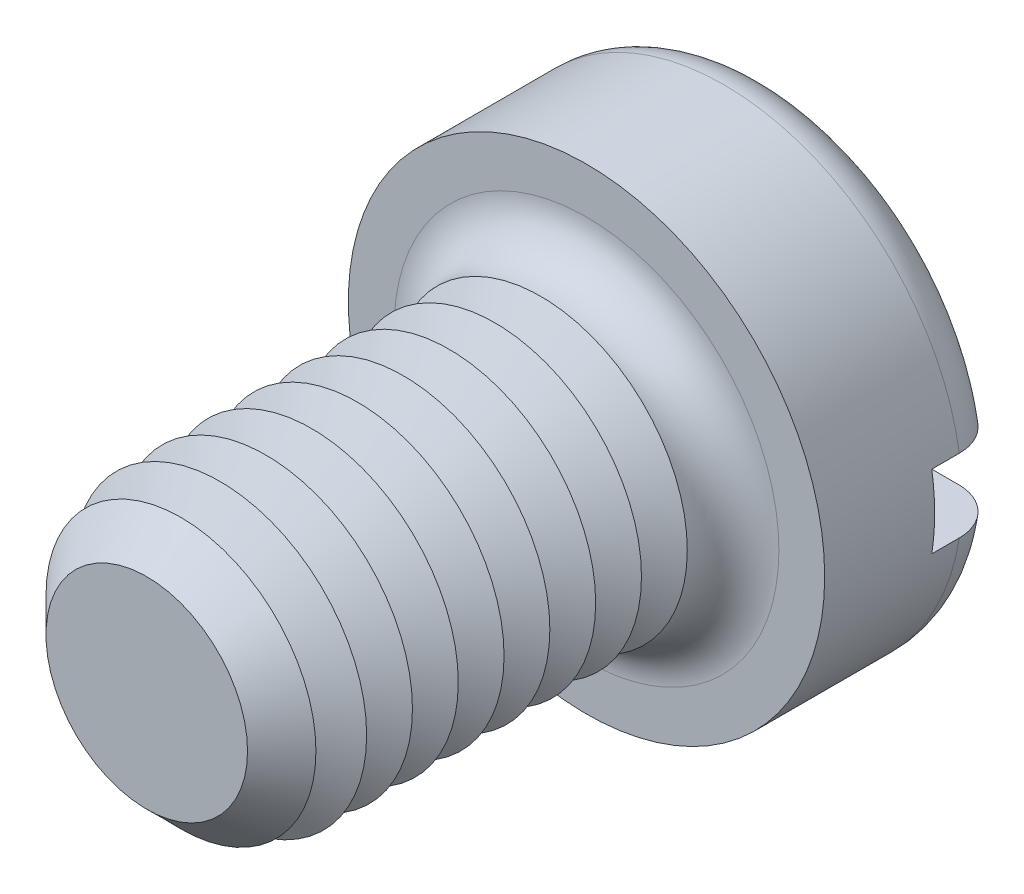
ISO-10303-21;
HEADER;
FILE_DESCRIPTION(('STEP AP214'),'2;1');
FILE_NAME('part.step','',(''),(''),'','','');
FILE_SCHEMA(('AUTOMOTIVE_DESIGN { 1 0 10303 214 1 1 1 1 }'));
ENDSEC;
DATA;
#1=APPLICATION_CONTEXT('core data for automotive mechanical design processes');
#2=APPLICATION_PROTOCOL_DEFINITION('international standard','automotive_design',2000,#1);
#3=PRODUCT_CONTEXT('',#1,'mechanical');
#4=PRODUCT('Part','Part','',(#3));
#5=PRODUCT_RELATED_PRODUCT_CATEGORY('part','',(#4));
#6=PRODUCT_DEFINITION_FORMATION('','',#4);
#7=PRODUCT_DEFINITION_CONTEXT('part definition',#1,'design');
#8=PRODUCT_DEFINITION('design','',#6,#7);
#9=PRODUCT_DEFINITION_SHAPE('','',#8);
#10=(LENGTH_UNIT() NAMED_UNIT(*) SI_UNIT(.MILLI.,.METRE.));
#11=(NAMED_UNIT(*) PLANE_ANGLE_UNIT() SI_UNIT($,.RADIAN.));
#12=(NAMED_UNIT(*) SI_UNIT($,.STERADIAN.) SOLID_ANGLE_UNIT());
#13=UNCERTAINTY_MEASURE_WITH_UNIT(LENGTH_MEASURE(1.E-05),#10,'distance_accuracy_value','');
#14=(GEOMETRIC_REPRESENTATION_CONTEXT(3) GLOBAL_UNCERTAINTY_ASSIGNED_CONTEXT((#13)) GLOBAL_UNIT_ASSIGNED_CONTEXT((#10,
#11,#12)) REPRESENTATION_CONTEXT('',''));
#15=CARTESIAN_POINT('',(0.,0.,0.));
#16=DIRECTION('',(0.,0.,1.));
#17=DIRECTION('',(1.,0.,0.));
#18=AXIS2_PLACEMENT_3D('',#15,#16,#17);
#19=CARTESIAN_POINT('',(0.,0.,-5.));
#20=DIRECTION('',(0.,0.,1.));
#21=DIRECTION('',(1.,0.,0.));
#22=AXIS2_PLACEMENT_3D('',#19,#20,#21);
#23=PLANE('',#22);
#24=CARTESIAN_POINT('',(0.,0.,-5.));
#25=DIRECTION('',(0.,0.,1.));
#26=DIRECTION('',(1.,0.,0.));
#27=AXIS2_PLACEMENT_3D('',#24,#25,#26);
#28=CIRCLE('',#27,5.25);
#29=CARTESIAN_POINT('',(-5.15388203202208,1.,-5.));
#30=VERTEX_POINT('',#29);
#31=CARTESIAN_POINT('',(5.15388203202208,1.,-5.));
#32=VERTEX_POINT('',#31);
#33=EDGE_CURVE('E116',#30,#32,#28,.F.);
#34=ORIENTED_EDGE('',*,*,#33,.T.);
#35=DIRECTION('',(1.,0.,0.));
#36=VECTOR('',#35,1.);
#37=CARTESIAN_POINT('',(-6.5,1.,-5.));
#38=LINE('',#37,#36);
#39=EDGE_CURVE('E111',#30,#32,#38,.T.);
#40=ORIENTED_EDGE('',*,*,#39,.F.);
#41=EDGE_LOOP('',(#34,#40));
#42=FACE_BOUND('',#41,.T.);
#43=ADVANCED_FACE('F39',(#42),#23,.F.);
#44=CARTESIAN_POINT('',(0.,0.,-3.75));
#45=DIRECTION('',(0.,0.,1.));
#46=DIRECTION('',(1.,0.,0.));
#47=AXIS2_PLACEMENT_3D('',#44,#45,#46);
#48=TOROIDAL_SURFACE('',#47,5.25,1.25);
#49=CARTESIAN_POINT('',(-6.04655789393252,1.,-4.63904490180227));
#50=CARTESIAN_POINT('',(-5.99546860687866,1.,-4.68885774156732));
#51=CARTESIAN_POINT('',(-5.94008472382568,1.,-4.73434760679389));
#52=CARTESIAN_POINT('',(-5.8223927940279,1.,-4.81538052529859));
#53=CARTESIAN_POINT('',(-5.7600753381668,1.,-4.85090982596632));
#54=CARTESIAN_POINT('',(-5.63044351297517,1.,-4.91100606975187));
#55=CARTESIAN_POINT('',(-5.56313479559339,1.,-4.93558519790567));
#56=CARTESIAN_POINT('',(-5.42539577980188,1.,-4.97322457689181));
#57=CARTESIAN_POINT('',(-5.35496625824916,1.,-4.98628767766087));
#58=CARTESIAN_POINT('',(-5.21212635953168,1.,-5.00070478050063));
#59=CARTESIAN_POINT('',(-5.13970265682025,1.,-5.00192674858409));
#60=CARTESIAN_POINT('',(-4.99565121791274,1.,-4.99234085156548));
#61=CARTESIAN_POINT('',(-4.92402357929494,1.,-4.98153152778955));
#62=CARTESIAN_POINT('',(-4.78274786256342,1.,-4.94801424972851));
#63=CARTESIAN_POINT('',(-4.71313137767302,1.,-4.92517296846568));
#64=CARTESIAN_POINT('',(-4.57871041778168,1.,-4.86813760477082));
#65=CARTESIAN_POINT('',(-4.51390612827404,1.,-4.83394308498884));
#66=CARTESIAN_POINT('',(-4.39095493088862,1.,-4.75508341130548));
#67=CARTESIAN_POINT('',(-4.33281197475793,1.,-4.7104120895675));
#68=CARTESIAN_POINT('',(-4.22499800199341,1.,-4.61179869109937));
#69=CARTESIAN_POINT('',(-4.17532640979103,1.,-4.55785724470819));
#70=CARTESIAN_POINT('',(-4.08677450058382,1.,-4.4431082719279));
#71=CARTESIAN_POINT('',(-4.0477350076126,1.,-4.38242369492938));
#72=CARTESIAN_POINT('',(-3.98074296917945,1.,-4.25521412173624));
#73=CARTESIAN_POINT('',(-3.95278836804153,1.,-4.18869021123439));
#74=CARTESIAN_POINT('',(-3.90959497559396,1.,-4.0537026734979));
#75=CARTESIAN_POINT('',(-3.89401985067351,1.,-3.98534663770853));
#76=CARTESIAN_POINT('',(-3.8748586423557,1.,-3.84697740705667));
#77=CARTESIAN_POINT('',(-3.87127067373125,1.,-3.7769644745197));
#78=CARTESIAN_POINT('',(-3.8761573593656,1.,-3.63892215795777));
#79=CARTESIAN_POINT('',(-3.88436651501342,1.,-3.57088319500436));
#80=CARTESIAN_POINT('',(-3.91207743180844,1.,-3.43714958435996));
#81=CARTESIAN_POINT('',(-3.93157911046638,1.,-3.37145491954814));
#82=CARTESIAN_POINT('',(-3.98125045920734,1.,-3.24411474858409));
#83=CARTESIAN_POINT('',(-4.01143761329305,1.,-3.18247607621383));
#84=CARTESIAN_POINT('',(-4.08150210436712,1.,-3.064981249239));
#85=CARTESIAN_POINT('',(-4.12138048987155,1.,-3.0091257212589));
#86=CARTESIAN_POINT('',(-4.2106718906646,1.,-2.90336353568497));
#87=CARTESIAN_POINT('',(-4.26028693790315,1.,-2.85362751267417));
#88=CARTESIAN_POINT('',(-4.36696587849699,1.,-2.76291710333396));
#89=CARTESIAN_POINT('',(-4.42403082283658,1.,-2.72194395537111));
#90=CARTESIAN_POINT('',(-4.54567957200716,1.,-2.64877280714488));
#91=CARTESIAN_POINT('',(-4.61042643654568,1.,-2.61684571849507));
#92=CARTESIAN_POINT('',(-4.74430563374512,1.,-2.56412359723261));
#93=CARTESIAN_POINT('',(-4.81343838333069,1.,-2.54332962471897));
#94=CARTESIAN_POINT('',(-4.95527237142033,1.,-2.51320471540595));
#95=CARTESIAN_POINT('',(-5.0280120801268,1.,-2.50405449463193));
#96=CARTESIAN_POINT('',(-5.17399775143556,1.,-2.49810126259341));
#97=CARTESIAN_POINT('',(-5.24724372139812,1.,-2.50129843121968));
#98=CARTESIAN_POINT('',(-5.3921014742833,1.,-2.52000776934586));
#99=CARTESIAN_POINT('',(-5.4637142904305,1.,-2.53551191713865));
#100=CARTESIAN_POINT('',(-5.60326680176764,1.,-2.57846304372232));
#101=CARTESIAN_POINT('',(-5.67120668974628,1.,-2.60590939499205));
#102=CARTESIAN_POINT('',(-5.80064060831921,1.,-2.67164926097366));
#103=CARTESIAN_POINT('',(-5.862199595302,1.,-2.7098148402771));
#104=CARTESIAN_POINT('',(-5.9779079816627,1.,-2.79608690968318));
#105=CARTESIAN_POINT('',(-6.03205795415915,1.,-2.84419263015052));
#106=CARTESIAN_POINT('',(-6.13055119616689,1.,-2.94820522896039));
#107=CARTESIAN_POINT('',(-6.17502887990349,1.,-3.00398483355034));
#108=CARTESIAN_POINT('',(-6.25384180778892,1.,-3.12230113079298));
#109=CARTESIAN_POINT('',(-6.28817779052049,1.,-3.18483733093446));
#110=CARTESIAN_POINT('',(-6.34527986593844,1.,-3.31401726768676));
#111=CARTESIAN_POINT('',(-6.36818984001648,1.,-3.38059742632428));
#112=CARTESIAN_POINT('',(-6.40240470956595,1.,-3.5166725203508));
#113=CARTESIAN_POINT('',(-6.41371067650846,1.,-3.58616718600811));
#114=CARTESIAN_POINT('',(-6.42433240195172,1.,-3.72550026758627));
#115=CARTESIAN_POINT('',(-6.4237441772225,1.,-3.79533138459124));
#116=CARTESIAN_POINT('',(-6.41082814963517,1.,-3.93391789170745));
#117=CARTESIAN_POINT('',(-6.39849757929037,1.,-4.00267302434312));
#118=CARTESIAN_POINT('',(-6.36249191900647,1.,-4.13704597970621));
#119=CARTESIAN_POINT('',(-6.33883072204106,1.,-4.20266753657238));
#120=CARTESIAN_POINT('',(-6.28088769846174,1.,-4.32897165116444));
#121=CARTESIAN_POINT('',(-6.24661890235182,1.,-4.38966015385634));
#122=CARTESIAN_POINT('',(-6.18404039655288,1.,-4.48163773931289));
#123=CARTESIAN_POINT('',(-6.15876600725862,1.,-4.51503333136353));
#124=CARTESIAN_POINT('',(-6.10500607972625,1.,-4.5791298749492));
#125=CARTESIAN_POINT('',(-6.07652056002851,1.,-4.60983084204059));
#126=CARTESIAN_POINT('',(-6.04655789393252,1.,-4.63904490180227));
#127=B_SPLINE_CURVE_WITH_KNOTS('',3,(#49,#50,#51,#52,#53,#54,#55,#56,#57,#58,#59,#60,#61,#62,
#63,#64,#65,#66,#67,#68,#69,#70,#71,#72,#73,#74,#75,#76,#77,#78,#79,#80,#81,#82,#83,#84,#85,#86,
#87,#88,#89,#90,#91,#92,#93,#94,#95,#96,#97,#98,#99,#100,#101,#102,#103,#104,#105,#106,#107,
#108,#109,#110,#111,#112,#113,#114,#115,#116,#117,#118,#119,#120,#121,#122,#123,#124,#125,#126),
.UNSPECIFIED.,.T.,.F.,(4,2,2,2,2,2,2,2,2,2,2,2,2,2,2,2,2,2,2,2,2,2,2,2,2,2,2,2,2,2,2,2,2,2,2,2,
2,2,4),(0.,0.213907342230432,0.428108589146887,0.642070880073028,0.855980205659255,
1.07227200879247,1.28859003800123,1.50735715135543,1.72613269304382,1.94503735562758,
2.16392713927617,2.37933295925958,2.59469881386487,2.80399176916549,3.01325180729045,
3.2178754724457,3.42249764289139,3.62745618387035,3.83243690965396,4.04223444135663,
4.25206160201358,4.46763253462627,4.68322399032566,4.90212226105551,5.12102372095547,
5.33978261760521,5.55853002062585,5.77477015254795,5.99099354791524,6.20398686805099,
6.41696467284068,6.62718821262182,6.83739233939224,7.0459002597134,7.25445733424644,
7.46275934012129,7.67080647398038,7.79625882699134,7.92171045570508),.UNSPECIFIED.);
#128=CARTESIAN_POINT('',(-6.42261628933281,1.,-3.74999999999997));
#129=VERTEX_POINT('',#128);
#130=EDGE_CURVE('E248',#129,#30,#127,.T.);
#131=ORIENTED_EDGE('',*,*,#130,.F.);
#132=CARTESIAN_POINT('',(0.,0.,-3.75));
#133=DIRECTION('',(0.,0.,1.));
#134=DIRECTION('',(1.,0.,0.));
#135=AXIS2_PLACEMENT_3D('',#132,#133,#134);
#136=CIRCLE('',#135,6.5);
#137=CARTESIAN_POINT('',(6.42261628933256,1.,-3.75));
#138=VERTEX_POINT('',#137);
#139=EDGE_CURVE('E124',#138,#129,#136,.T.);
#140=ORIENTED_EDGE('',*,*,#139,.F.);
#141=CARTESIAN_POINT('',(4.06944999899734,1.,-4.4133199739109));
#142=CARTESIAN_POINT('',(4.10828271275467,1.,-4.47354709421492));
#143=CARTESIAN_POINT('',(4.15233880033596,1.,-4.53047894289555));
#144=CARTESIAN_POINT('',(4.24946916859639,1.,-4.63614530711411));
#145=CARTESIAN_POINT('',(4.3025574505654,1.,-4.68486685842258));
#146=CARTESIAN_POINT('',(4.41603250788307,1.,-4.77271114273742));
#147=CARTESIAN_POINT('',(4.47640839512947,1.,-4.8118479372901));
#148=CARTESIAN_POINT('',(4.60277035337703,1.,-4.87959878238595));
#149=CARTESIAN_POINT('',(4.66875480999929,1.,-4.90821584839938));
#150=CARTESIAN_POINT('',(4.80558589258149,1.,-4.95456537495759));
#151=CARTESIAN_POINT('',(4.87649196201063,1.,-4.97212253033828));
#152=CARTESIAN_POINT('',(5.02024710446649,1.,-4.99514979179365));
#153=CARTESIAN_POINT('',(5.09309636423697,1.,-5.00061873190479));
#154=CARTESIAN_POINT('',(5.23902872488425,1.,-4.99926689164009));
#155=CARTESIAN_POINT('',(5.31211131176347,1.,-4.99238812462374));
#156=CARTESIAN_POINT('',(5.45605806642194,1.,-4.96635140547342));
#157=CARTESIAN_POINT('',(5.52692231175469,1.,-4.94719388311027));
#158=CARTESIAN_POINT('',(5.66376170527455,1.,-4.89728421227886));
#159=CARTESIAN_POINT('',(5.72977335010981,1.,-4.86663219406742));
#160=CARTESIAN_POINT('',(5.85560715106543,1.,-4.79452334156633));
#161=CARTESIAN_POINT('',(5.91542977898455,1.,-4.7530673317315));
#162=CARTESIAN_POINT('',(6.02626022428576,1.,-4.66116821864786));
#163=CARTESIAN_POINT('',(6.07738307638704,1.,-4.6108638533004));
#164=CARTESIAN_POINT('',(6.17030947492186,1.,-4.50227823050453));
#165=CARTESIAN_POINT('',(6.2121137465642,1.,-4.44399759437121));
#166=CARTESIAN_POINT('',(6.28460268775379,1.,-4.32200305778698));
#167=CARTESIAN_POINT('',(6.31543589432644,1.,-4.2583773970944));
#168=CARTESIAN_POINT('',(6.36586009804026,1.,-4.12681721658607));
#169=CARTESIAN_POINT('',(6.38545178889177,1.,-4.0588829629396));
#170=CARTESIAN_POINT('',(6.41265760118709,1.,-3.92136007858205));
#171=CARTESIAN_POINT('',(6.42038873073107,1.,-3.85179457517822));
#172=CARTESIAN_POINT('',(6.42401070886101,1.,-3.7123569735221));
#173=CARTESIAN_POINT('',(6.41990193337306,1.,-3.64248488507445));
#174=CARTESIAN_POINT('',(6.40000894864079,1.,-3.50470871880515));
#175=CARTESIAN_POINT('',(6.38427119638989,1.,-3.43679792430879));
#176=CARTESIAN_POINT('',(6.34164491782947,1.,-3.30457296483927));
#177=CARTESIAN_POINT('',(6.31475638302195,1.,-3.24025880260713));
#178=CARTESIAN_POINT('',(6.2505455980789,1.,-3.11686791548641));
#179=CARTESIAN_POINT('',(6.21319759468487,1.,-3.05780459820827));
#180=CARTESIAN_POINT('',(6.12919411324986,1.,-2.94671919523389));
#181=CARTESIAN_POINT('',(6.08253833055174,1.,-2.89469734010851));
#182=CARTESIAN_POINT('',(5.98083387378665,1.,-2.79868150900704));
#183=CARTESIAN_POINT('',(5.92571704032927,1.,-2.75475975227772));
#184=CARTESIAN_POINT('',(5.80897194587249,1.,-2.67665277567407));
#185=CARTESIAN_POINT('',(5.74734329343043,1.,-2.64246814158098));
#186=CARTESIAN_POINT('',(5.6184644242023,1.,-2.58431810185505));
#187=CARTESIAN_POINT('',(5.55115102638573,1.,-2.56049275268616));
#188=CARTESIAN_POINT('',(5.41351272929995,1.,-2.52429868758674));
#189=CARTESIAN_POINT('',(5.34318759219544,1.,-2.51193087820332));
#190=CARTESIAN_POINT('',(5.20041507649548,1.,-2.49882112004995));
#191=CARTESIAN_POINT('',(5.12795169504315,1.,-2.49825332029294));
#192=CARTESIAN_POINT('',(4.98393373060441,1.,-2.50914771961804));
#193=CARTESIAN_POINT('',(4.91237921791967,1.,-2.52061084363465));
#194=CARTESIAN_POINT('',(4.77137358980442,1.,-2.55542281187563));
#195=CARTESIAN_POINT('',(4.70195472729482,1.,-2.57890245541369));
#196=CARTESIAN_POINT('',(4.56803538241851,1.,-2.63717701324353));
#197=CARTESIAN_POINT('',(4.50353509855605,1.,-2.67197238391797));
#198=CARTESIAN_POINT('',(4.38131858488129,1.,-2.7519648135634));
#199=CARTESIAN_POINT('',(4.32360365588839,1.,-2.79716386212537));
#200=CARTESIAN_POINT('',(4.21673400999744,1.,-2.89675634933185));
#201=CARTESIAN_POINT('',(4.16757871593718,1.,-2.95114916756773));
#202=CARTESIAN_POINT('',(4.08014713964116,1.,-3.06667703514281));
#203=CARTESIAN_POINT('',(4.04170608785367,1.,-3.12768727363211));
#204=CARTESIAN_POINT('',(3.97596192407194,1.,-3.25543782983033));
#205=CARTESIAN_POINT('',(3.94865624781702,1.,-3.32217682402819));
#206=CARTESIAN_POINT('',(3.9067737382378,1.,-3.45745603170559));
#207=CARTESIAN_POINT('',(3.89185707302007,1.,-3.52589108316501));
#208=CARTESIAN_POINT('',(3.87400755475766,1.,-3.66432360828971));
#209=CARTESIAN_POINT('',(3.87107601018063,1.,-3.73432125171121));
#210=CARTESIAN_POINT('',(3.8772387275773,1.,-3.87228267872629));
#211=CARTESIAN_POINT('',(3.88607933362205,1.,-3.94025811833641));
#212=CARTESIAN_POINT('',(3.91502769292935,1.,-4.07370133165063));
#213=CARTESIAN_POINT('',(3.93512131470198,1.,-4.1391721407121));
#214=CARTESIAN_POINT('',(3.9752037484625,1.,-4.23926719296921));
#215=CARTESIAN_POINT('',(3.99171171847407,1.,-4.27532618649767));
#216=CARTESIAN_POINT('',(4.02809737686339,1.,-4.34569933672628));
#217=CARTESIAN_POINT('',(4.04797497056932,1.,-4.3800135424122));
#218=CARTESIAN_POINT('',(4.06944999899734,1.,-4.4133199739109));
#219=B_SPLINE_CURVE_WITH_KNOTS('',3,(#141,#142,#143,#144,#145,#146,#147,#148,#149,#150,#151,
#152,#153,#154,#155,#156,#157,#158,#159,#160,#161,#162,#163,#164,#165,#166,#167,#168,#169,#170,
#171,#172,#173,#174,#175,#176,#177,#178,#179,#180,#181,#182,#183,#184,#185,#186,#187,#188,#189,
#190,#191,#192,#193,#194,#195,#196,#197,#198,#199,#200,#201,#202,#203,#204,#205,#206,#207,#208,
#209,#210,#211,#212,#213,#214,#215,#216,#217,#218),.UNSPECIFIED.,.T.,.F.,(4,2,2,2,2,2,2,2,2,2,2,
2,2,2,2,2,2,2,2,2,2,2,2,2,2,2,2,2,2,2,2,2,2,2,2,2,2,2,4),(0.,0.214833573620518,
0.430003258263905,0.644855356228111,0.859645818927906,1.0777603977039,1.29589601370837,
1.51505870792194,1.73421373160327,1.95150241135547,2.16877451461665,2.38290237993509,
2.59701357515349,2.8081044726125,3.01918234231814,3.22816416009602,3.43713934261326,
3.64528416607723,3.85342914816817,4.06209119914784,4.27076008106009,4.48120788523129,
4.69166834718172,4.90489186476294,5.11813225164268,5.33451752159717,5.55091942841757,
5.76972860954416,5.98854661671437,6.20740650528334,6.42625163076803,6.64151774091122,
6.85673425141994,7.0658317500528,7.27495207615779,7.47963858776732,7.68406862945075,
7.80287790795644,7.92168384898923),.UNSPECIFIED.);
#220=EDGE_CURVE('E250',#32,#138,#219,.T.);
#221=ORIENTED_EDGE('',*,*,#220,.F.);
#222=ORIENTED_EDGE('',*,*,#33,.F.);
#223=EDGE_LOOP('',(#131,#140,#221,#222));
#224=FACE_BOUND('',#223,.T.);
#225=ADVANCED_FACE('F232',(#224),#48,.T.);
#226=CARTESIAN_POINT('',(0.,0.,-5.));
#227=DIRECTION('',(0.,0.,1.));
#228=DIRECTION('',(1.,0.,0.));
#229=AXIS2_PLACEMENT_3D('',#226,#227,#228);
#230=CYLINDRICAL_SURFACE('',#229,6.5);
#231=DIRECTION('',(0.,0.,1.));
#232=VECTOR('',#231,1.);
#233=CARTESIAN_POINT('',(6.42261628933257,1.,-5.));
#234=LINE('',#233,#232);
#235=CARTESIAN_POINT('',(6.42261628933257,1.,-3.));
#236=VERTEX_POINT('',#235);
#237=EDGE_CURVE('E265',#138,#236,#234,.T.);
#238=ORIENTED_EDGE('',*,*,#237,.F.);
#239=ORIENTED_EDGE('',*,*,#139,.T.);
#240=DIRECTION('',(0.,0.,1.));
#241=VECTOR('',#240,1.);
#242=CARTESIAN_POINT('',(-6.42261628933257,1.,-5.));
#243=LINE('',#242,#241);
#244=CARTESIAN_POINT('',(-6.42261628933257,1.,-3.));
#245=VERTEX_POINT('',#244);
#246=EDGE_CURVE('E63',#245,#129,#243,.F.);
#247=ORIENTED_EDGE('',*,*,#246,.F.);
#248=CARTESIAN_POINT('',(0.,0.,-3.));
#249=DIRECTION('',(0.,0.,-1.));
#250=DIRECTION('',(-1.,0.,0.));
#251=AXIS2_PLACEMENT_3D('',#248,#249,#250);
#252=CIRCLE('',#251,6.5);
#253=CARTESIAN_POINT('',(-6.42261628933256,-0.999999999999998,-3.));
#254=VERTEX_POINT('',#253);
#255=EDGE_CURVE('E43',#245,#254,#252,.F.);
#256=ORIENTED_EDGE('',*,*,#255,.T.);
#257=DIRECTION('',(0.,0.,1.));
#258=VECTOR('',#257,1.);
#259=CARTESIAN_POINT('',(-6.42261628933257,-0.999999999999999,-5.));
#260=LINE('',#259,#258);
#261=CARTESIAN_POINT('',(-6.42261628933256,-0.999999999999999,-3.75));
#262=VERTEX_POINT('',#261);
#263=EDGE_CURVE('E262',#262,#254,#260,.T.);
#264=ORIENTED_EDGE('',*,*,#263,.F.);
#265=CARTESIAN_POINT('',(6.42261628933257,-1.,-3.75));
#266=VERTEX_POINT('',#265);
#267=EDGE_CURVE('E126',#262,#266,#136,.T.);
#268=ORIENTED_EDGE('',*,*,#267,.T.);
#269=DIRECTION('',(0.,0.,1.));
#270=VECTOR('',#269,1.);
#271=CARTESIAN_POINT('',(6.42261628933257,-1.,-5.));
#272=LINE('',#271,#270);
#273=CARTESIAN_POINT('',(6.42261628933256,-1.,-3.));
#274=VERTEX_POINT('',#273);
#275=EDGE_CURVE('E55',#274,#266,#272,.F.);
#276=ORIENTED_EDGE('',*,*,#275,.F.);
#277=EDGE_CURVE('E11',#274,#236,#252,.F.);
#278=ORIENTED_EDGE('',*,*,#277,.T.);
#279=EDGE_LOOP('',(#238,#239,#247,#256,#264,#268,#276,#278));
#280=FACE_BOUND('',#279,.T.);
#281=CARTESIAN_POINT('',(0.,0.,0.));
#282=DIRECTION('',(0.,0.,1.));
#283=DIRECTION('',(1.,0.,0.));
#284=AXIS2_PLACEMENT_3D('',#281,#282,#283);
#285=CIRCLE('',#284,6.5);
#286=CARTESIAN_POINT('',(6.5,0.,0.));
#287=VERTEX_POINT('',#286);
#288=EDGE_CURVE('E267',#287,#287,#285,.T.);
#289=ORIENTED_EDGE('',*,*,#288,.F.);
#290=EDGE_LOOP('',(#289));
#291=FACE_BOUND('',#290,.T.);
#292=ADVANCED_FACE('F228',(#280,#291),#230,.T.);
#293=CARTESIAN_POINT('',(5.15388203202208,-1.,-5.));
#294=VERTEX_POINT('',#293);
#295=CARTESIAN_POINT('',(-5.15388203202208,-0.999999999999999,-5.));
#296=VERTEX_POINT('',#295);
#297=EDGE_CURVE('E109',#294,#296,#28,.F.);
#298=ORIENTED_EDGE('',*,*,#297,.T.);
#299=DIRECTION('',(-1.,0.,0.));
#300=VECTOR('',#299,1.);
#301=CARTESIAN_POINT('',(-6.5,-0.999999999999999,-5.));
#302=LINE('',#301,#300);
#303=EDGE_CURVE('E96',#294,#296,#302,.T.);
#304=ORIENTED_EDGE('',*,*,#303,.F.);
#305=EDGE_LOOP('',(#298,#304));
#306=FACE_BOUND('',#305,.T.);
#307=ADVANCED_FACE('F108',(#306),#23,.F.);
#308=CARTESIAN_POINT('',(0.,0.,0.));
#309=DIRECTION('',(0.,0.,1.));
#310=DIRECTION('',(1.,0.,0.));
#311=AXIS2_PLACEMENT_3D('',#308,#309,#310);
#312=PLANE('',#311);
#313=CARTESIAN_POINT('',(0.,0.,0.));
#314=DIRECTION('',(0.,0.,1.));
#315=DIRECTION('',(1.,0.,0.));
#316=AXIS2_PLACEMENT_3D('',#313,#314,#315);
#317=CIRCLE('',#316,5.25);
#318=CARTESIAN_POINT('',(5.25,0.,0.));
#319=VERTEX_POINT('',#318);
#320=EDGE_CURVE('E115',#319,#319,#317,.F.);
#321=ORIENTED_EDGE('',*,*,#320,.T.);
#322=EDGE_LOOP('',(#321));
#323=FACE_BOUND('',#322,.T.);
#324=ORIENTED_EDGE('',*,*,#288,.T.);
#325=EDGE_LOOP('',(#324));
#326=FACE_BOUND('',#325,.T.);
#327=ADVANCED_FACE('F227',(#323,#326),#312,.T.);
#328=CARTESIAN_POINT('',(-6.04655789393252,-0.999999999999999,-4.63904490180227));
#329=CARTESIAN_POINT('',(-6.0966604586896,-0.999999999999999,-4.59018532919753));
#330=CARTESIAN_POINT('',(-6.14270501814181,-0.999999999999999,-4.53709744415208));
#331=CARTESIAN_POINT('',(-6.22528519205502,-0.999999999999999,-4.42391631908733));
#332=CARTESIAN_POINT('',(-6.26181074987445,-0.999999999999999,-4.36381576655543));
#333=CARTESIAN_POINT('',(-6.32422109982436,-0.999999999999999,-4.23831836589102));
#334=CARTESIAN_POINT('',(-6.35010658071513,-0.999999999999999,-4.17292186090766));
#335=CARTESIAN_POINT('',(-6.39044668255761,-0.999999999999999,-4.03870925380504));
#336=CARTESIAN_POINT('',(-6.40490396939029,-0.999999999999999,-3.96989395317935));
#337=CARTESIAN_POINT('',(-6.42190814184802,-0.999999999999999,-3.83122595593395));
#338=CARTESIAN_POINT('',(-6.4245257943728,-0.999999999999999,-3.76138193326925));
#339=CARTESIAN_POINT('',(-6.41796432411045,-0.999999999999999,-3.62224935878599));
#340=CARTESIAN_POINT('',(-6.40878509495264,-0.999999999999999,-3.55296081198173));
#341=CARTESIAN_POINT('',(-6.37894560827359,-0.999999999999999,-3.41709241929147));
#342=CARTESIAN_POINT('',(-6.35831520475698,-0.999999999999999,-3.35050601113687));
#343=CARTESIAN_POINT('',(-6.30620980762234,-0.999999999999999,-3.22172312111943));
#344=CARTESIAN_POINT('',(-6.2747347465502,-0.999999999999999,-3.15952666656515));
#345=CARTESIAN_POINT('',(-6.20172710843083,-0.999999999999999,-3.04101762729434));
#346=CARTESIAN_POINT('',(-6.16015622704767,-0.999999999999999,-2.98472864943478));
#347=CARTESIAN_POINT('',(-6.06823774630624,-0.999999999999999,-2.87984578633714));
#348=CARTESIAN_POINT('',(-6.01788981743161,-0.999999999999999,-2.83125219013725));
#349=CARTESIAN_POINT('',(-5.90933830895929,-0.999999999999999,-2.74262118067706));
#350=CARTESIAN_POINT('',(-5.85106338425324,-0.999999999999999,-2.70267117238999));
#351=CARTESIAN_POINT('',(-5.72870702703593,-0.999999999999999,-2.63296796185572));
#352=CARTESIAN_POINT('',(-5.66462521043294,-0.999999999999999,-2.6032154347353));
#353=CARTESIAN_POINT('',(-5.53153273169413,-0.999999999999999,-2.55430842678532));
#354=CARTESIAN_POINT('',(-5.46246626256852,-0.999999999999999,-2.53530583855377));
#355=CARTESIAN_POINT('',(-5.32214267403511,-0.999999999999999,-2.5089831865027));
#356=CARTESIAN_POINT('',(-5.25088537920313,-0.999999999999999,-2.50166406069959));
#357=CARTESIAN_POINT('',(-5.10710123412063,-0.999999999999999,-2.49882202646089));
#358=CARTESIAN_POINT('',(-5.03457095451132,-0.999999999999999,-2.50347166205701));
#359=CARTESIAN_POINT('',(-4.8912897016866,-0.999999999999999,-2.52476029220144));
#360=CARTESIAN_POINT('',(-4.82053886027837,-0.999999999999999,-2.54140017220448));
#361=CARTESIAN_POINT('',(-4.68213257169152,-0.999999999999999,-2.58641614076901));
#362=CARTESIAN_POINT('',(-4.61451256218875,-0.999999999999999,-2.61490131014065));
#363=CARTESIAN_POINT('',(-4.48502801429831,-0.999999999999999,-2.68285095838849));
#364=CARTESIAN_POINT('',(-4.42316359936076,-0.999999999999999,-2.72231567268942));
#365=CARTESIAN_POINT('',(-4.30720694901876,-0.999999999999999,-2.81103994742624));
#366=CARTESIAN_POINT('',(-4.25309118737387,-0.999999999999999,-2.86026872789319));
#367=CARTESIAN_POINT('',(-4.15409408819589,-0.999999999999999,-2.9672764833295));
#368=CARTESIAN_POINT('',(-4.10921182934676,-0.999999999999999,-3.02505460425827));
#369=CARTESIAN_POINT('',(-4.03096584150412,-0.999999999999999,-3.14632492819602));
#370=CARTESIAN_POINT('',(-3.99739097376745,-0.999999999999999,-3.2096807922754));
#371=CARTESIAN_POINT('',(-3.94171839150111,-0.999999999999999,-3.34124912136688));
#372=CARTESIAN_POINT('',(-3.91961840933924,-0.999999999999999,-3.40946062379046));
#373=CARTESIAN_POINT('',(-3.88816636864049,-0.999999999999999,-3.54669256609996));
#374=CARTESIAN_POINT('',(-3.87846562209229,-0.999999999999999,-3.61563318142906));
#375=CARTESIAN_POINT('',(-3.87100568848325,-0.999999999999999,-3.75415397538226));
#376=CARTESIAN_POINT('',(-3.87324501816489,-0.999999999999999,-3.82373407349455));
#377=CARTESIAN_POINT('',(-3.88943589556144,-0.999999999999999,-3.96027701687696));
#378=CARTESIAN_POINT('',(-3.90318225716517,-0.999999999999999,-4.0272643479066));
#379=CARTESIAN_POINT('',(-3.94163954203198,-0.999999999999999,-4.1580093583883));
#380=CARTESIAN_POINT('',(-3.96635075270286,-0.999999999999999,-4.22176695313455));
#381=CARTESIAN_POINT('',(-4.026160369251,-0.999999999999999,-4.34483320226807));
#382=CARTESIAN_POINT('',(-4.06134035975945,-0.999999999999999,-4.40410214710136));
#383=CARTESIAN_POINT('',(-4.14090865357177,-0.999999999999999,-4.51609417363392));
#384=CARTESIAN_POINT('',(-4.18529811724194,-0.999999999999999,-4.56881642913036));
#385=CARTESIAN_POINT('',(-4.2832649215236,-0.999999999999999,-4.66770177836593));
#386=CARTESIAN_POINT('',(-4.33705327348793,-0.999999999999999,-4.71365579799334));
#387=CARTESIAN_POINT('',(-4.45141776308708,-0.999999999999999,-4.79615385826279));
#388=CARTESIAN_POINT('',(-4.51199483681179,-0.999999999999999,-4.83269659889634));
#389=CARTESIAN_POINT('',(-4.63989216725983,-0.999999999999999,-4.89626962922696));
#390=CARTESIAN_POINT('',(-4.70734508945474,-0.999999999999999,-4.92303326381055));
#391=CARTESIAN_POINT('',(-4.84575497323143,-0.999999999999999,-4.96500199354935));
#392=CARTESIAN_POINT('',(-4.91671207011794,-0.999999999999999,-4.98020664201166));
#393=CARTESIAN_POINT('',(-5.06097761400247,-0.999999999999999,-4.9987306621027));
#394=CARTESIAN_POINT('',(-5.13430353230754,-0.999999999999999,-5.00191441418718));
#395=CARTESIAN_POINT('',(-5.28046546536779,-0.999999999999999,-4.99587686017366));
#396=CARTESIAN_POINT('',(-5.35330135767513,-0.999999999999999,-4.98665256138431));
#397=CARTESIAN_POINT('',(-5.49610354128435,-0.999999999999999,-4.95604184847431));
#398=CARTESIAN_POINT('',(-5.56607890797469,-0.999999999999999,-4.93469772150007));
#399=CARTESIAN_POINT('',(-5.70131538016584,-0.999999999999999,-4.88041956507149));
#400=CARTESIAN_POINT('',(-5.76658233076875,-0.999999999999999,-4.84750021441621));
#401=CARTESIAN_POINT('',(-5.86782577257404,-0.999999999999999,-4.78498748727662));
#402=CARTESIAN_POINT('',(-5.90579749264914,-0.999999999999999,-4.75856648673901));
#403=CARTESIAN_POINT('',(-5.97862186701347,-0.999999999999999,-4.70172646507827));
#404=CARTESIAN_POINT('',(-6.0134745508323,-0.999999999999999,-4.6713074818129));
#405=CARTESIAN_POINT('',(-6.04655789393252,-0.999999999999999,-4.63904490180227));
#406=B_SPLINE_CURVE_WITH_KNOTS('',3,(#328,#329,#330,#331,#332,#333,#334,#335,#336,#337,#338,
#339,#340,#341,#342,#343,#344,#345,#346,#347,#348,#349,#350,#351,#352,#353,#354,#355,#356,#357,
#358,#359,#360,#361,#362,#363,#364,#365,#366,#367,#368,#369,#370,#371,#372,#373,#374,#375,#376,
#377,#378,#379,#380,#381,#382,#383,#384,#385,#386,#387,#388,#389,#390,#391,#392,#393,#394,#395,
#396,#397,#398,#399,#400,#401,#402,#403,#404,#405),.UNSPECIFIED.,.T.,.F.,(4,2,2,2,2,2,2,2,2,2,2,
2,2,2,2,2,2,2,2,2,2,2,2,2,2,2,2,2,2,2,2,2,2,2,2,2,2,2,4),(0.,0.209780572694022,
0.419781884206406,0.629769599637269,0.839708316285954,1.04839053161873,1.2570746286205,
1.46521720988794,1.67336108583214,1.88230736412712,2.09126148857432,2.30223890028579,
2.51323027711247,2.72713284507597,2.94105258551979,3.15807345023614,3.37511034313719,
3.59419176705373,3.81327788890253,4.03168404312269,4.25006839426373,4.46411376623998,
4.67811682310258,4.88595885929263,5.09377507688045,5.29796268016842,5.50215563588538,
5.70798353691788,5.91383738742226,6.12510741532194,6.33640661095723,6.55309998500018,
6.76980173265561,6.98894112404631,7.20813337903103,7.42656551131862,7.64472163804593,
7.78324365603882,7.92176436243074),.UNSPECIFIED.);
#407=EDGE_CURVE('E103',#296,#262,#406,.T.);
#408=ORIENTED_EDGE('',*,*,#407,.F.);
#409=ORIENTED_EDGE('',*,*,#297,.F.);
#410=CARTESIAN_POINT('',(4.06944999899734,-1.,-4.4133199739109));
#411=CARTESIAN_POINT('',(4.03213207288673,-1.,-4.3554312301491));
#412=CARTESIAN_POINT('',(3.9995849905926,-1.,-4.29441722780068));
#413=CARTESIAN_POINT('',(3.94511822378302,-1.,-4.16776604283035));
#414=CARTESIAN_POINT('',(3.92320762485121,-1.,-4.10212496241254));
#415=CARTESIAN_POINT('',(3.89078811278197,-1.,-3.96804412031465));
#416=CARTESIAN_POINT('',(3.88028409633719,-1.,-3.89960316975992));
#417=CARTESIAN_POINT('',(3.87107895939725,-1.,-3.76194650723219));
#418=CARTESIAN_POINT('',(3.87237511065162,-1.,-3.69273097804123));
#419=CARTESIAN_POINT('',(3.88662927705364,-1.,-3.55634460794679));
#420=CARTESIAN_POINT('',(3.89944923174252,-1.,-3.48915926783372));
#421=CARTESIAN_POINT('',(3.93611188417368,-1.,-3.35786953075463));
#422=CARTESIAN_POINT('',(3.95995518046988,-1.,-3.29376530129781));
#423=CARTESIAN_POINT('',(4.0180748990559,-1.,-3.16993562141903));
#424=CARTESIAN_POINT('',(4.05242297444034,-1.,-3.11024385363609));
#425=CARTESIAN_POINT('',(4.13041121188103,-1.,-2.9972793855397));
#426=CARTESIAN_POINT('',(4.17405248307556,-1.,-2.94400745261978));
#427=CARTESIAN_POINT('',(4.27058636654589,-1.,-2.8439150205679));
#428=CARTESIAN_POINT('',(4.32368948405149,-1.,-2.79729757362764));
#429=CARTESIAN_POINT('',(4.43679856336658,-1.,-2.71336600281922));
#430=CARTESIAN_POINT('',(4.49680546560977,-1.,-2.67605314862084));
#431=CARTESIAN_POINT('',(4.62370121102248,-1.,-2.61081752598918));
#432=CARTESIAN_POINT('',(4.69072799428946,-1.,-2.58316284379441));
#433=CARTESIAN_POINT('',(4.82843981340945,-1.,-2.5393441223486));
#434=CARTESIAN_POINT('',(4.899125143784,-1.,-2.52318100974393));
#435=CARTESIAN_POINT('',(5.04306377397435,-1.,-2.50267755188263));
#436=CARTESIAN_POINT('',(5.11633773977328,-1.,-2.49848181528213));
#437=CARTESIAN_POINT('',(5.26254809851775,-1.,-2.50249357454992));
#438=CARTESIAN_POINT('',(5.33548449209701,-1.,-2.51070104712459));
#439=CARTESIAN_POINT('',(5.4786703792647,-1.,-2.53930888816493));
#440=CARTESIAN_POINT('',(5.54892819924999,-1.,-2.5596675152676));
#441=CARTESIAN_POINT('',(5.68495799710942,-1.,-2.61204238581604));
#442=CARTESIAN_POINT('',(5.75073024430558,-1.,-2.64405792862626));
#443=CARTESIAN_POINT('',(5.8750178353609,-1.,-2.7184150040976));
#444=CARTESIAN_POINT('',(5.93361487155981,-1.,-2.76061995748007));
#445=CARTESIAN_POINT('',(6.04275377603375,-1.,-2.85440601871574));
#446=CARTESIAN_POINT('',(6.09329629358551,-1.,-2.90598637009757));
#447=CARTESIAN_POINT('',(6.18409572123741,-1.,-3.01622977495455));
#448=CARTESIAN_POINT('',(6.2244945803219,-1.,-3.07477592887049));
#449=CARTESIAN_POINT('',(6.29474798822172,-1.,-3.19788594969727));
#450=CARTESIAN_POINT('',(6.3246032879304,-1.,-3.26244938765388));
#451=CARTESIAN_POINT('',(6.37256001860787,-1.,-3.39491634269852));
#452=CARTESIAN_POINT('',(6.39079949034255,-1.,-3.46276990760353));
#453=CARTESIAN_POINT('',(6.41554133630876,-1.,-3.60058363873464));
#454=CARTESIAN_POINT('',(6.42204424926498,-1.,-3.67054370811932));
#455=CARTESIAN_POINT('',(6.42311237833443,-1.,-3.81007982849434));
#456=CARTESIAN_POINT('',(6.41775799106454,-1.,-3.879655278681));
#457=CARTESIAN_POINT('',(6.39543799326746,-1.,-4.01691664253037));
#458=CARTESIAN_POINT('',(6.3784725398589,-1.,-4.08460258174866));
#459=CARTESIAN_POINT('',(6.33344768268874,-1.,-4.21614537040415));
#460=CARTESIAN_POINT('',(6.30539273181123,-1.,-4.28000374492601));
#461=CARTESIAN_POINT('',(6.23902076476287,-1.,-4.40214140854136));
#462=CARTESIAN_POINT('',(6.20070356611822,-1.,-4.46042059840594));
#463=CARTESIAN_POINT('',(6.11467174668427,-1.,-4.5701315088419));
#464=CARTESIAN_POINT('',(6.06690270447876,-1.,-4.62152053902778));
#465=CARTESIAN_POINT('',(5.96350111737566,-1.,-4.715657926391));
#466=CARTESIAN_POINT('',(5.90786817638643,-1.,-4.75840584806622));
#467=CARTESIAN_POINT('',(5.78965380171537,-1.,-4.8345781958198));
#468=CARTESIAN_POINT('',(5.72700078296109,-1.,-4.86789149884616));
#469=CARTESIAN_POINT('',(5.59704977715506,-1.,-4.92369754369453));
#470=CARTESIAN_POINT('',(5.52975144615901,-1.,-4.94618948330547));
#471=CARTESIAN_POINT('',(5.39137621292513,-1.,-4.98006173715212));
#472=CARTESIAN_POINT('',(5.32025859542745,-1.,-4.99127571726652));
#473=CARTESIAN_POINT('',(5.17715081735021,-1.,-5.00177798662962));
#474=CARTESIAN_POINT('',(5.10516061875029,-1.,-5.00106575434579));
#475=CARTESIAN_POINT('',(4.96131924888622,-1.,-4.98769775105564));
#476=CARTESIAN_POINT('',(4.88948297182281,-1.,-4.97488146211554));
#477=CARTESIAN_POINT('',(4.74893184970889,-1.,-4.93744335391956));
#478=CARTESIAN_POINT('',(4.68021795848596,-1.,-4.91281795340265));
#479=CARTESIAN_POINT('',(4.54744428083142,-1.,-4.8522329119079));
#480=CARTESIAN_POINT('',(4.48341761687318,-1.,-4.81620070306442));
#481=CARTESIAN_POINT('',(4.36244497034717,-1.,-4.73383277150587));
#482=CARTESIAN_POINT('',(4.30549069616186,-1.,-4.68750929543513));
#483=CARTESIAN_POINT('',(4.21823158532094,-1.,-4.60311228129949));
#484=CARTESIAN_POINT('',(4.18544074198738,-1.,-4.56757118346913));
#485=CARTESIAN_POINT('',(4.12413461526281,-1.,-4.49297229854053));
#486=CARTESIAN_POINT('',(4.09561926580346,-1.,-4.45391456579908));
#487=CARTESIAN_POINT('',(4.06944999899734,-1.,-4.4133199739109));
#488=B_SPLINE_CURVE_WITH_KNOTS('',3,(#410,#411,#412,#413,#414,#415,#416,#417,#418,#419,#420,
#421,#422,#423,#424,#425,#426,#427,#428,#429,#430,#431,#432,#433,#434,#435,#436,#437,#438,#439,
#440,#441,#442,#443,#444,#445,#446,#447,#448,#449,#450,#451,#452,#453,#454,#455,#456,#457,#458,
#459,#460,#461,#462,#463,#464,#465,#466,#467,#468,#469,#470,#471,#472,#473,#474,#475,#476,#477,
#478,#479,#480,#481,#482,#483,#484,#485,#486,#487),.UNSPECIFIED.,.T.,.F.,(4,2,2,2,2,2,2,2,2,2,2,
2,2,2,2,2,2,2,2,2,2,2,2,2,2,2,2,2,2,2,2,2,2,2,2,2,2,2,4),(0.,0.206453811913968,0.4130836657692,
0.619802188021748,0.826472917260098,1.03070015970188,1.23493849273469,1.44060223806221,
1.64629054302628,1.85731119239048,2.06836062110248,2.28487349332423,2.5014038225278,
2.72053974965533,2.9396752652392,3.15806230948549,3.37643622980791,3.59203140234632,
3.80760918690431,4.01997696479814,4.23232961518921,4.44210913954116,4.65187903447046,
4.86023097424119,5.06858009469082,5.27684563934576,5.48511488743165,5.69462015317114,
5.90413597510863,6.11602561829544,6.32793096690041,6.54291770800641,6.75791385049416,
6.97580180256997,7.19375587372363,7.41312537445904,7.63223520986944,7.77701357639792,
7.92178970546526),.UNSPECIFIED.);
#489=EDGE_CURVE('E92',#266,#294,#488,.T.);
#490=ORIENTED_EDGE('',*,*,#489,.F.);
#491=ORIENTED_EDGE('',*,*,#267,.F.);
#492=EDGE_LOOP('',(#408,#409,#490,#491));
#493=FACE_BOUND('',#492,.T.);
#494=ADVANCED_FACE('F113',(#493),#48,.T.);
#495=CARTESIAN_POINT('',(0.,0.,1.25));
#496=DIRECTION('',(0.,0.,1.));
#497=DIRECTION('',(1.,0.,0.));
#498=AXIS2_PLACEMENT_3D('',#495,#496,#497);
#499=TOROIDAL_SURFACE('',#498,5.25,1.25);
#500=ORIENTED_EDGE('',*,*,#320,.F.);
#501=EDGE_LOOP('',(#500));
#502=FACE_BOUND('',#501,.T.);
#503=CARTESIAN_POINT('',(0.,0.,1.25));
#504=DIRECTION('',(0.,0.,-1.));
#505=DIRECTION('',(-1.,0.,0.));
#506=AXIS2_PLACEMENT_3D('',#503,#504,#505);
#507=CIRCLE('',#506,4.);
#508=CARTESIAN_POINT('',(-4.,0.,1.25));
#509=VERTEX_POINT('',#508);
#510=EDGE_CURVE('E271',#509,#509,#507,.T.);
#511=ORIENTED_EDGE('',*,*,#510,.T.);
#512=EDGE_LOOP('',(#511));
#513=FACE_BOUND('',#512,.T.);
#514=ADVANCED_FACE('F220',(#502,#513),#499,.F.);
#515=CARTESIAN_POINT('',(0.,0.,1.875));
#516=DIRECTION('',(0.,0.,-1.));
#517=DIRECTION('',(-1.,0.,0.));
#518=AXIS2_PLACEMENT_3D('',#515,#516,#517);
#519=CONICAL_SURFACE('',#518,2.91746824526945,1.0471975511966);
#520=ORIENTED_EDGE('',*,*,#510,.F.);
#521=EDGE_LOOP('',(#520));
#522=FACE_BOUND('',#521,.T.);
#523=CARTESIAN_POINT('',(0.,0.,1.875));
#524=DIRECTION('',(0.,0.,-1.));
#525=DIRECTION('',(-1.,0.,0.));
#526=AXIS2_PLACEMENT_3D('',#523,#524,#525);
#527=CIRCLE('',#526,2.91746824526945);
#528=CARTESIAN_POINT('',(-2.91746824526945,0.,1.875));
#529=VERTEX_POINT('',#528);
#530=EDGE_CURVE('E277',#529,#529,#527,.T.);
#531=ORIENTED_EDGE('',*,*,#530,.T.);
#532=EDGE_LOOP('',(#531));
#533=FACE_BOUND('',#532,.T.);
#534=ADVANCED_FACE('F216',(#522,#533),#519,.T.);
#535=CARTESIAN_POINT('',(0.,0.,2.5));
#536=DIRECTION('',(0.,0.,1.));
#537=DIRECTION('',(1.,0.,0.));
#538=AXIS2_PLACEMENT_3D('',#535,#536,#537);
#539=CONICAL_SURFACE('',#538,4.,1.0471975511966);
#540=ORIENTED_EDGE('',*,*,#530,.F.);
#541=EDGE_LOOP('',(#540));
#542=FACE_BOUND('',#541,.T.);
#543=CARTESIAN_POINT('',(0.,0.,2.5));
#544=DIRECTION('',(0.,0.,-1.));
#545=DIRECTION('',(-1.,0.,0.));
#546=AXIS2_PLACEMENT_3D('',#543,#544,#545);
#547=CIRCLE('',#546,4.);
#548=CARTESIAN_POINT('',(-4.,0.,2.5));
#549=VERTEX_POINT('',#548);
#550=EDGE_CURVE('E283',#549,#549,#547,.T.);
#551=ORIENTED_EDGE('',*,*,#550,.T.);
#552=EDGE_LOOP('',(#551));
#553=FACE_BOUND('',#552,.T.);
#554=ADVANCED_FACE('F212',(#542,#553),#539,.T.);
#555=CARTESIAN_POINT('',(0.,0.,3.125));
#556=DIRECTION('',(0.,0.,-1.));
#557=DIRECTION('',(-1.,0.,0.));
#558=AXIS2_PLACEMENT_3D('',#555,#556,#557);
#559=CONICAL_SURFACE('',#558,2.91746824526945,1.0471975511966);
#560=ORIENTED_EDGE('',*,*,#550,.F.);
#561=EDGE_LOOP('',(#560));
#562=FACE_BOUND('',#561,.T.);
#563=CARTESIAN_POINT('',(0.,0.,3.125));
#564=DIRECTION('',(0.,0.,-1.));
#565=DIRECTION('',(-1.,0.,0.));
#566=AXIS2_PLACEMENT_3D('',#563,#564,#565);
#567=CIRCLE('',#566,2.91746824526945);
#568=CARTESIAN_POINT('',(-2.91746824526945,0.,3.125));
#569=VERTEX_POINT('',#568);
#570=EDGE_CURVE('E287',#569,#569,#567,.T.);
#571=ORIENTED_EDGE('',*,*,#570,.T.);
#572=EDGE_LOOP('',(#571));
#573=FACE_BOUND('',#572,.T.);
#574=ADVANCED_FACE('F208',(#562,#573),#559,.T.);
#575=CARTESIAN_POINT('',(0.,0.,3.75));
#576=DIRECTION('',(0.,0.,1.));
#577=DIRECTION('',(1.,0.,0.));
#578=AXIS2_PLACEMENT_3D('',#575,#576,#577);
#579=CONICAL_SURFACE('',#578,4.,1.0471975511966);
#580=ORIENTED_EDGE('',*,*,#570,.F.);
#581=EDGE_LOOP('',(#580));
#582=FACE_BOUND('',#581,.T.);
#583=CARTESIAN_POINT('',(0.,0.,3.75));
#584=DIRECTION('',(0.,0.,-1.));
#585=DIRECTION('',(-1.,0.,0.));
#586=AXIS2_PLACEMENT_3D('',#583,#584,#585);
#587=CIRCLE('',#586,4.);
#588=CARTESIAN_POINT('',(-4.,0.,3.75));
#589=VERTEX_POINT('',#588);
#590=EDGE_CURVE('E291',#589,#589,#587,.T.);
#591=ORIENTED_EDGE('',*,*,#590,.T.);
#592=EDGE_LOOP('',(#591));
#593=FACE_BOUND('',#592,.T.);
#594=ADVANCED_FACE('F204',(#582,#593),#579,.T.);
#595=CARTESIAN_POINT('',(0.,0.,4.375));
#596=DIRECTION('',(0.,0.,-1.));
#597=DIRECTION('',(-1.,0.,0.));
#598=AXIS2_PLACEMENT_3D('',#595,#596,#597);
#599=CONICAL_SURFACE('',#598,2.91746824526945,1.0471975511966);
#600=ORIENTED_EDGE('',*,*,#590,.F.);
#601=EDGE_LOOP('',(#600));
#602=FACE_BOUND('',#601,.T.);
#603=CARTESIAN_POINT('',(0.,0.,4.375));
#604=DIRECTION('',(0.,0.,-1.));
#605=DIRECTION('',(-1.,0.,0.));
#606=AXIS2_PLACEMENT_3D('',#603,#604,#605);
#607=CIRCLE('',#606,2.91746824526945);
#608=CARTESIAN_POINT('',(-2.91746824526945,0.,4.375));
#609=VERTEX_POINT('',#608);
#610=EDGE_CURVE('E294',#609,#609,#607,.T.);
#611=ORIENTED_EDGE('',*,*,#610,.T.);
#612=EDGE_LOOP('',(#611));
#613=FACE_BOUND('',#612,.T.);
#614=ADVANCED_FACE('F200',(#602,#613),#599,.T.);
#615=CARTESIAN_POINT('',(0.,0.,5.));
#616=DIRECTION('',(0.,0.,1.));
#617=DIRECTION('',(1.,0.,0.));
#618=AXIS2_PLACEMENT_3D('',#615,#616,#617);
#619=CONICAL_SURFACE('',#618,4.,1.0471975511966);
#620=ORIENTED_EDGE('',*,*,#610,.F.);
#621=EDGE_LOOP('',(#620));
#622=FACE_BOUND('',#621,.T.);
#623=CARTESIAN_POINT('',(0.,0.,5.));
#624=DIRECTION('',(0.,0.,-1.));
#625=DIRECTION('',(-1.,0.,0.));
#626=AXIS2_PLACEMENT_3D('',#623,#624,#625);
#627=CIRCLE('',#626,4.);
#628=CARTESIAN_POINT('',(-4.,0.,5.));
#629=VERTEX_POINT('',#628);
#630=EDGE_CURVE('E298',#629,#629,#627,.T.);
#631=ORIENTED_EDGE('',*,*,#630,.T.);
#632=EDGE_LOOP('',(#631));
#633=FACE_BOUND('',#632,.T.);
#634=ADVANCED_FACE('F196',(#622,#633),#619,.T.);
#635=CARTESIAN_POINT('',(0.,0.,5.625));
#636=DIRECTION('',(0.,0.,-1.));
#637=DIRECTION('',(-1.,0.,0.));
#638=AXIS2_PLACEMENT_3D('',#635,#636,#637);
#639=CONICAL_SURFACE('',#638,2.91746824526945,1.0471975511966);
#640=ORIENTED_EDGE('',*,*,#630,.F.);
#641=EDGE_LOOP('',(#640));
#642=FACE_BOUND('',#641,.T.);
#643=CARTESIAN_POINT('',(0.,0.,5.625));
#644=DIRECTION('',(0.,0.,-1.));
#645=DIRECTION('',(-1.,0.,0.));
#646=AXIS2_PLACEMENT_3D('',#643,#644,#645);
#647=CIRCLE('',#646,2.91746824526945);
#648=CARTESIAN_POINT('',(-2.91746824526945,0.,5.625));
#649=VERTEX_POINT('',#648);
#650=EDGE_CURVE('E302',#649,#649,#647,.T.);
#651=ORIENTED_EDGE('',*,*,#650,.T.);
#652=EDGE_LOOP('',(#651));
#653=FACE_BOUND('',#652,.T.);
#654=ADVANCED_FACE('F192',(#642,#653),#639,.T.);
#655=CARTESIAN_POINT('',(0.,0.,6.25));
#656=DIRECTION('',(0.,0.,1.));
#657=DIRECTION('',(1.,0.,0.));
#658=AXIS2_PLACEMENT_3D('',#655,#656,#657);
#659=CONICAL_SURFACE('',#658,4.,1.0471975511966);
#660=ORIENTED_EDGE('',*,*,#650,.F.);
#661=EDGE_LOOP('',(#660));
#662=FACE_BOUND('',#661,.T.);
#663=CARTESIAN_POINT('',(0.,0.,6.25));
#664=DIRECTION('',(0.,0.,-1.));
#665=DIRECTION('',(-1.,0.,0.));
#666=AXIS2_PLACEMENT_3D('',#663,#664,#665);
#667=CIRCLE('',#666,4.);
#668=CARTESIAN_POINT('',(-4.,0.,6.25));
#669=VERTEX_POINT('',#668);
#670=EDGE_CURVE('E306',#669,#669,#667,.T.);
#671=ORIENTED_EDGE('',*,*,#670,.T.);
#672=EDGE_LOOP('',(#671));
#673=FACE_BOUND('',#672,.T.);
#674=ADVANCED_FACE('F188',(#662,#673),#659,.T.);
#675=CARTESIAN_POINT('',(0.,0.,6.875));
#676=DIRECTION('',(0.,0.,-1.));
#677=DIRECTION('',(-1.,0.,0.));
#678=AXIS2_PLACEMENT_3D('',#675,#676,#677);
#679=CONICAL_SURFACE('',#678,2.91746824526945,1.0471975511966);
#680=ORIENTED_EDGE('',*,*,#670,.F.);
#681=EDGE_LOOP('',(#680));
#682=FACE_BOUND('',#681,.T.);
#683=CARTESIAN_POINT('',(0.,0.,6.875));
#684=DIRECTION('',(0.,0.,-1.));
#685=DIRECTION('',(-1.,0.,0.));
#686=AXIS2_PLACEMENT_3D('',#683,#684,#685);
#687=CIRCLE('',#686,2.91746824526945);
#688=CARTESIAN_POINT('',(-2.91746824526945,0.,6.875));
#689=VERTEX_POINT('',#688);
#690=EDGE_CURVE('E310',#689,#689,#687,.T.);
#691=ORIENTED_EDGE('',*,*,#690,.T.);
#692=EDGE_LOOP('',(#691));
#693=FACE_BOUND('',#692,.T.);
#694=ADVANCED_FACE('F184',(#682,#693),#679,.T.);
#695=CARTESIAN_POINT('',(0.,0.,7.5));
#696=DIRECTION('',(0.,0.,1.));
#697=DIRECTION('',(1.,0.,0.));
#698=AXIS2_PLACEMENT_3D('',#695,#696,#697);
#699=CONICAL_SURFACE('',#698,4.,1.0471975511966);
#700=ORIENTED_EDGE('',*,*,#690,.F.);
#701=EDGE_LOOP('',(#700));
#702=FACE_BOUND('',#701,.T.);
#703=CARTESIAN_POINT('',(0.,0.,7.5));
#704=DIRECTION('',(0.,0.,-1.));
#705=DIRECTION('',(-1.,0.,0.));
#706=AXIS2_PLACEMENT_3D('',#703,#704,#705);
#707=CIRCLE('',#706,4.);
#708=CARTESIAN_POINT('',(-4.,0.,7.5));
#709=VERTEX_POINT('',#708);
#710=EDGE_CURVE('E314',#709,#709,#707,.T.);
#711=ORIENTED_EDGE('',*,*,#710,.T.);
#712=EDGE_LOOP('',(#711));
#713=FACE_BOUND('',#712,.T.);
#714=ADVANCED_FACE('F180',(#702,#713),#699,.T.);
#715=CARTESIAN_POINT('',(0.,0.,8.125));
#716=DIRECTION('',(0.,0.,-1.));
#717=DIRECTION('',(-1.,0.,0.));
#718=AXIS2_PLACEMENT_3D('',#715,#716,#717);
#719=CONICAL_SURFACE('',#718,2.91746824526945,1.0471975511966);
#720=ORIENTED_EDGE('',*,*,#710,.F.);
#721=EDGE_LOOP('',(#720));
#722=FACE_BOUND('',#721,.T.);
#723=CARTESIAN_POINT('',(0.,0.,8.125));
#724=DIRECTION('',(0.,0.,-1.));
#725=DIRECTION('',(-1.,0.,0.));
#726=AXIS2_PLACEMENT_3D('',#723,#724,#725);
#727=CIRCLE('',#726,2.91746824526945);
#728=CARTESIAN_POINT('',(-2.91746824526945,0.,8.125));
#729=VERTEX_POINT('',#728);
#730=EDGE_CURVE('E318',#729,#729,#727,.T.);
#731=ORIENTED_EDGE('',*,*,#730,.T.);
#732=EDGE_LOOP('',(#731));
#733=FACE_BOUND('',#732,.T.);
#734=ADVANCED_FACE('F176',(#722,#733),#719,.T.);
#735=CARTESIAN_POINT('',(0.,0.,8.75));
#736=DIRECTION('',(0.,0.,1.));
#737=DIRECTION('',(1.,0.,0.));
#738=AXIS2_PLACEMENT_3D('',#735,#736,#737);
#739=CONICAL_SURFACE('',#738,4.,1.0471975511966);
#740=ORIENTED_EDGE('',*,*,#730,.F.);
#741=EDGE_LOOP('',(#740));
#742=FACE_BOUND('',#741,.T.);
#743=CARTESIAN_POINT('',(0.,0.,8.75));
#744=DIRECTION('',(0.,0.,-1.));
#745=DIRECTION('',(-1.,0.,0.));
#746=AXIS2_PLACEMENT_3D('',#743,#744,#745);
#747=CIRCLE('',#746,4.);
#748=CARTESIAN_POINT('',(-4.,0.,8.75));
#749=VERTEX_POINT('',#748);
#750=EDGE_CURVE('E322',#749,#749,#747,.T.);
#751=ORIENTED_EDGE('',*,*,#750,.T.);
#752=EDGE_LOOP('',(#751));
#753=FACE_BOUND('',#752,.T.);
#754=ADVANCED_FACE('F172',(#742,#753),#739,.T.);
#755=CARTESIAN_POINT('',(0.,0.,9.375));
#756=DIRECTION('',(0.,0.,-1.));
#757=DIRECTION('',(-1.,0.,0.));
#758=AXIS2_PLACEMENT_3D('',#755,#756,#757);
#759=CONICAL_SURFACE('',#758,2.91746824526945,1.0471975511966);
#760=ORIENTED_EDGE('',*,*,#750,.F.);
#761=EDGE_LOOP('',(#760));
#762=FACE_BOUND('',#761,.T.);
#763=CARTESIAN_POINT('',(0.,0.,9.375));
#764=DIRECTION('',(0.,0.,-1.));
#765=DIRECTION('',(-1.,0.,0.));
#766=AXIS2_PLACEMENT_3D('',#763,#764,#765);
#767=CIRCLE('',#766,2.91746824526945);
#768=CARTESIAN_POINT('',(-2.91746824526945,0.,9.375));
#769=VERTEX_POINT('',#768);
#770=EDGE_CURVE('E135',#769,#769,#767,.T.);
#771=ORIENTED_EDGE('',*,*,#770,.T.);
#772=EDGE_LOOP('',(#771));
#773=FACE_BOUND('',#772,.T.);
#774=ADVANCED_FACE('F168',(#762,#773),#759,.T.);
#775=CARTESIAN_POINT('',(0.,0.,10.));
#776=DIRECTION('',(0.,0.,1.));
#777=DIRECTION('',(1.,0.,0.));
#778=AXIS2_PLACEMENT_3D('',#775,#776,#777);
#779=CONICAL_SURFACE('',#778,4.,1.0471975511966);
#780=ORIENTED_EDGE('',*,*,#770,.F.);
#781=EDGE_LOOP('',(#780));
#782=FACE_BOUND('',#781,.T.);
#783=CARTESIAN_POINT('',(0.,0.,10.));
#784=DIRECTION('',(0.,0.,-1.));
#785=DIRECTION('',(-1.,0.,0.));
#786=AXIS2_PLACEMENT_3D('',#783,#784,#785);
#787=CIRCLE('',#786,4.);
#788=CARTESIAN_POINT('',(-4.,0.,10.));
#789=VERTEX_POINT('',#788);
#790=EDGE_CURVE('E136',#789,#789,#787,.T.);
#791=ORIENTED_EDGE('',*,*,#790,.T.);
#792=EDGE_LOOP('',(#791));
#793=FACE_BOUND('',#792,.T.);
#794=ADVANCED_FACE('F164',(#782,#793),#779,.T.);
#795=CARTESIAN_POINT('',(0.,0.,10.625));
#796=DIRECTION('',(0.,0.,-1.));
#797=DIRECTION('',(-1.,0.,0.));
#798=AXIS2_PLACEMENT_3D('',#795,#796,#797);
#799=CONICAL_SURFACE('',#798,2.91746824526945,1.0471975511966);
#800=ORIENTED_EDGE('',*,*,#790,.F.);
#801=EDGE_LOOP('',(#800));
#802=FACE_BOUND('',#801,.T.);
#803=CARTESIAN_POINT('',(0.,0.,10.625));
#804=DIRECTION('',(0.,0.,-1.));
#805=DIRECTION('',(-1.,0.,0.));
#806=AXIS2_PLACEMENT_3D('',#803,#804,#805);
#807=CIRCLE('',#806,2.91746824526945);
#808=CARTESIAN_POINT('',(-2.91746824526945,0.,10.625));
#809=VERTEX_POINT('',#808);
#810=EDGE_CURVE('E332',#809,#809,#807,.T.);
#811=ORIENTED_EDGE('',*,*,#810,.T.);
#812=EDGE_LOOP('',(#811));
#813=FACE_BOUND('',#812,.T.);
#814=ADVANCED_FACE('F160',(#802,#813),#799,.T.);
#815=CARTESIAN_POINT('',(0.,0.,11.25));
#816=DIRECTION('',(0.,0.,1.));
#817=DIRECTION('',(1.,0.,0.));
#818=AXIS2_PLACEMENT_3D('',#815,#816,#817);
#819=CONICAL_SURFACE('',#818,4.,1.0471975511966);
#820=CARTESIAN_POINT('',(0.,0.,11.0669872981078));
#821=DIRECTION('',(0.,0.,1.));
#822=DIRECTION('',(1.,0.,0.));
#823=AXIS2_PLACEMENT_3D('',#820,#821,#822);
#824=CIRCLE('',#823,3.68301270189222);
#825=CARTESIAN_POINT('',(3.68301270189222,0.,11.0669872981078));
#826=VERTEX_POINT('',#825);
#827=EDGE_CURVE('E132',#826,#826,#824,.F.);
#828=ORIENTED_EDGE('',*,*,#827,.T.);
#829=EDGE_LOOP('',(#828));
#830=FACE_BOUND('',#829,.T.);
#831=ORIENTED_EDGE('',*,*,#810,.F.);
#832=EDGE_LOOP('',(#831));
#833=FACE_BOUND('',#832,.T.);
#834=ADVANCED_FACE('F155',(#830,#833),#819,.T.);
#835=CARTESIAN_POINT('',(0.,0.,12.));
#836=DIRECTION('',(0.,0.,1.));
#837=DIRECTION('',(1.,0.,0.));
#838=AXIS2_PLACEMENT_3D('',#835,#836,#837);
#839=PLANE('',#838);
#840=CARTESIAN_POINT('',(0.,0.,12.));
#841=DIRECTION('',(0.,0.,1.));
#842=DIRECTION('',(1.,0.,0.));
#843=AXIS2_PLACEMENT_3D('',#840,#841,#842);
#844=CIRCLE('',#843,2.75000000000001);
#845=CARTESIAN_POINT('',(2.75000000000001,0.,12.));
#846=VERTEX_POINT('',#845);
#847=EDGE_CURVE('E104',#846,#846,#844,.T.);
#848=ORIENTED_EDGE('',*,*,#847,.T.);
#849=EDGE_LOOP('',(#848));
#850=FACE_BOUND('',#849,.T.);
#851=ADVANCED_FACE('F159',(#850),#839,.T.);
#852=CARTESIAN_POINT('',(0.,0.,12.));
#853=DIRECTION('',(0.,0.,-1.));
#854=DIRECTION('',(-1.,0.,0.));
#855=AXIS2_PLACEMENT_3D('',#852,#853,#854);
#856=CONICAL_SURFACE('',#855,2.75000000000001,0.785398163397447);
#857=ORIENTED_EDGE('',*,*,#827,.F.);
#858=EDGE_LOOP('',(#857));
#859=FACE_BOUND('',#858,.T.);
#860=ORIENTED_EDGE('',*,*,#847,.F.);
#861=EDGE_LOOP('',(#860));
#862=FACE_BOUND('',#861,.T.);
#863=ADVANCED_FACE('F41',(#859,#862),#856,.T.);
#864=CARTESIAN_POINT('',(-6.5,1.,-3.));
#865=DIRECTION('',(0.,1.,0.));
#866=DIRECTION('',(-1.,0.,0.));
#867=AXIS2_PLACEMENT_3D('',#864,#865,#866);
#868=PLANE('',#867);
#869=ORIENTED_EDGE('',*,*,#246,.T.);
#870=ORIENTED_EDGE('',*,*,#130,.T.);
#871=ORIENTED_EDGE('',*,*,#39,.T.);
#872=ORIENTED_EDGE('',*,*,#220,.T.);
#873=ORIENTED_EDGE('',*,*,#237,.T.);
#874=DIRECTION('',(1.,0.,0.));
#875=VECTOR('',#874,1.);
#876=CARTESIAN_POINT('',(-6.5,1.,-3.));
#877=LINE('',#876,#875);
#878=EDGE_CURVE('E341',#245,#236,#877,.T.);
#879=ORIENTED_EDGE('',*,*,#878,.F.);
#880=EDGE_LOOP('',(#869,#870,#871,#872,#873,#879));
#881=FACE_BOUND('',#880,.T.);
#882=ADVANCED_FACE('F152',(#881),#868,.F.);
#883=CARTESIAN_POINT('',(-6.5,-0.999999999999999,-3.));
#884=DIRECTION('',(0.,-1.,0.));
#885=DIRECTION('',(1.,0.,0.));
#886=AXIS2_PLACEMENT_3D('',#883,#884,#885);
#887=PLANE('',#886);
#888=ORIENTED_EDGE('',*,*,#263,.T.);
#889=DIRECTION('',(-1.,0.,0.));
#890=VECTOR('',#889,1.);
#891=CARTESIAN_POINT('',(-6.5,-0.999999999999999,-3.));
#892=LINE('',#891,#890);
#893=EDGE_CURVE('E342',#274,#254,#892,.T.);
#894=ORIENTED_EDGE('',*,*,#893,.F.);
#895=ORIENTED_EDGE('',*,*,#275,.T.);
#896=ORIENTED_EDGE('',*,*,#489,.T.);
#897=ORIENTED_EDGE('',*,*,#303,.T.);
#898=ORIENTED_EDGE('',*,*,#407,.T.);
#899=EDGE_LOOP('',(#888,#894,#895,#896,#897,#898));
#900=FACE_BOUND('',#899,.T.);
#901=ADVANCED_FACE('F95',(#900),#887,.F.);
#902=CARTESIAN_POINT('',(0.,0.,-3.));
#903=DIRECTION('',(0.,0.,-1.));
#904=DIRECTION('',(-1.,0.,0.));
#905=AXIS2_PLACEMENT_3D('',#902,#903,#904);
#906=PLANE('',#905);
#907=ORIENTED_EDGE('',*,*,#893,.T.);
#908=ORIENTED_EDGE('',*,*,#255,.F.);
#909=ORIENTED_EDGE('',*,*,#878,.T.);
#910=ORIENTED_EDGE('',*,*,#277,.F.);
#911=EDGE_LOOP('',(#907,#908,#909,#910));
#912=FACE_BOUND('',#911,.T.);
#913=ADVANCED_FACE('F151',(#912),#906,.T.);
#914=CLOSED_SHELL('',(#43,#225,#292,#307,#327,#494,#514,#534,#554,#574,#594,#614,#634,#654,#674,
#694,#714,#734,#754,#774,#794,#814,#834,#851,#863,#882,#901,#913));
#915=MANIFOLD_SOLID_BREP('B2',#914);
#916=ADVANCED_BREP_SHAPE_REPRESENTATION('',(#18,#915),#14);
#917=SHAPE_DEFINITION_REPRESENTATION(#9,#916);
ENDSEC;
END-ISO-10303-21;
